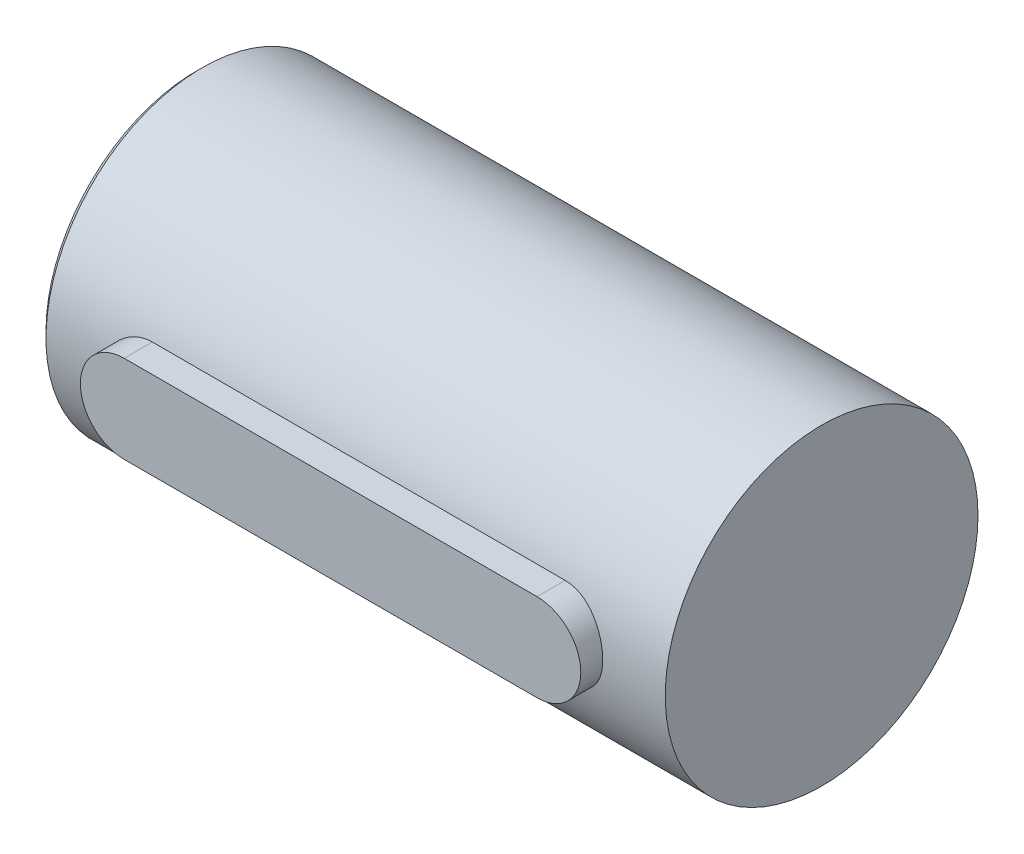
ISO-10303-21;
HEADER;
FILE_DESCRIPTION(('STEP AP214'),'2;1');
FILE_NAME('part.step','',(''),(''),'','','');
FILE_SCHEMA(('AUTOMOTIVE_DESIGN { 1 0 10303 214 1 1 1 1 }'));
ENDSEC;
DATA;
#1=APPLICATION_CONTEXT('core data for automotive mechanical design processes');
#2=APPLICATION_PROTOCOL_DEFINITION('international standard','automotive_design',2000,#1);
#3=PRODUCT_CONTEXT('',#1,'mechanical');
#4=PRODUCT('Part','Part','',(#3));
#5=PRODUCT_RELATED_PRODUCT_CATEGORY('part','',(#4));
#6=PRODUCT_DEFINITION_FORMATION('','',#4);
#7=PRODUCT_DEFINITION_CONTEXT('part definition',#1,'design');
#8=PRODUCT_DEFINITION('design','',#6,#7);
#9=PRODUCT_DEFINITION_SHAPE('','',#8);
#10=(LENGTH_UNIT() NAMED_UNIT(*) SI_UNIT(.MILLI.,.METRE.));
#11=(NAMED_UNIT(*) PLANE_ANGLE_UNIT() SI_UNIT($,.RADIAN.));
#12=(NAMED_UNIT(*) SI_UNIT($,.STERADIAN.) SOLID_ANGLE_UNIT());
#13=UNCERTAINTY_MEASURE_WITH_UNIT(LENGTH_MEASURE(1.E-05),#10,'distance_accuracy_value','');
#14=(GEOMETRIC_REPRESENTATION_CONTEXT(3) GLOBAL_UNCERTAINTY_ASSIGNED_CONTEXT((#13)) GLOBAL_UNIT_ASSIGNED_CONTEXT((#10,
#11,#12)) REPRESENTATION_CONTEXT('',''));
#15=CARTESIAN_POINT('',(0.,0.,0.));
#16=DIRECTION('',(0.,0.,1.));
#17=DIRECTION('',(1.,0.,0.));
#18=AXIS2_PLACEMENT_3D('',#15,#16,#17);
#19=CARTESIAN_POINT('',(-83.,0.,28.5));
#20=DIRECTION('',(0.,0.,1.));
#21=DIRECTION('',(0.,-1.,0.));
#22=AXIS2_PLACEMENT_3D('',#19,#20,#21);
#23=PLANE('',#22);
#24=CARTESIAN_POINT('',(-17.,0.,28.5));
#25=DIRECTION('',(0.,0.,1.));
#26=DIRECTION('',(0.,-1.,0.));
#27=AXIS2_PLACEMENT_3D('',#24,#25,#26);
#28=CIRCLE('',#27,7.);
#29=CARTESIAN_POINT('',(-17.,7.,28.5));
#30=VERTEX_POINT('',#29);
#31=CARTESIAN_POINT('',(-17.,-7.,28.5));
#32=VERTEX_POINT('',#31);
#33=EDGE_CURVE('E21',#30,#32,#28,.F.);
#34=ORIENTED_EDGE('',*,*,#33,.F.);
#35=DIRECTION('',(1.,0.,0.));
#36=VECTOR('',#35,1.);
#37=CARTESIAN_POINT('',(-50.,7.,28.5));
#38=LINE('',#37,#36);
#39=CARTESIAN_POINT('',(-83.,7.,28.5));
#40=VERTEX_POINT('',#39);
#41=EDGE_CURVE('E56',#30,#40,#38,.F.);
#42=ORIENTED_EDGE('',*,*,#41,.T.);
#43=CARTESIAN_POINT('',(-83.,0.,28.5));
#44=DIRECTION('',(0.,0.,1.));
#45=DIRECTION('',(0.,-1.,0.));
#46=AXIS2_PLACEMENT_3D('',#43,#44,#45);
#47=CIRCLE('',#46,7.);
#48=CARTESIAN_POINT('',(-83.,-7.,28.5));
#49=VERTEX_POINT('',#48);
#50=EDGE_CURVE('E65',#49,#40,#47,.F.);
#51=ORIENTED_EDGE('',*,*,#50,.F.);
#52=DIRECTION('',(1.,0.,0.));
#53=VECTOR('',#52,1.);
#54=CARTESIAN_POINT('',(-50.,-7.,28.5));
#55=LINE('',#54,#53);
#56=EDGE_CURVE('E61',#49,#32,#55,.T.);
#57=ORIENTED_EDGE('',*,*,#56,.T.);
#58=EDGE_LOOP('',(#34,#42,#51,#57));
#59=FACE_BOUND('',#58,.T.);
#60=ADVANCED_FACE('F16',(#59),#23,.T.);
#61=CARTESIAN_POINT('',(-50.,7.,14.25));
#62=DIRECTION('',(0.,-1.,0.));
#63=DIRECTION('',(0.,0.,-1.));
#64=AXIS2_PLACEMENT_3D('',#61,#62,#63);
#65=PLANE('',#64);
#66=DIRECTION('',(0.,0.,1.));
#67=VECTOR('',#66,1.);
#68=CARTESIAN_POINT('',(-83.,7.,14.25));
#69=LINE('',#68,#67);
#70=CARTESIAN_POINT('',(-83.,7.,24.));
#71=VERTEX_POINT('',#70);
#72=EDGE_CURVE('E118',#40,#71,#69,.F.);
#73=ORIENTED_EDGE('',*,*,#72,.F.);
#74=ORIENTED_EDGE('',*,*,#41,.F.);
#75=DIRECTION('',(0.,0.,1.));
#76=VECTOR('',#75,1.);
#77=CARTESIAN_POINT('',(-17.,7.,14.25));
#78=LINE('',#77,#76);
#79=CARTESIAN_POINT('',(-17.,7.,24.));
#80=VERTEX_POINT('',#79);
#81=EDGE_CURVE('E71',#80,#30,#78,.T.);
#82=ORIENTED_EDGE('',*,*,#81,.F.);
#83=DIRECTION('',(1.,0.,0.));
#84=VECTOR('',#83,1.);
#85=CARTESIAN_POINT('',(-49.5,7.,24.));
#86=LINE('',#85,#84);
#87=EDGE_CURVE('E114',#71,#80,#86,.T.);
#88=ORIENTED_EDGE('',*,*,#87,.F.);
#89=EDGE_LOOP('',(#73,#74,#82,#88));
#90=FACE_BOUND('',#89,.T.);
#91=ADVANCED_FACE('F125',(#90),#65,.F.);
#92=CARTESIAN_POINT('',(-100.,0.,-12.));
#93=DIRECTION('',(-1.,0.,0.));
#94=DIRECTION('',(0.,0.,1.));
#95=AXIS2_PLACEMENT_3D('',#92,#93,#94);
#96=PLANE('',#95);
#97=CARTESIAN_POINT('',(-100.,0.,0.));
#98=DIRECTION('',(1.,0.,0.));
#99=DIRECTION('',(0.,0.,-1.));
#100=AXIS2_PLACEMENT_3D('',#97,#98,#99);
#101=CIRCLE('',#100,24.);
#102=CARTESIAN_POINT('',(-100.,0.,-24.));
#103=VERTEX_POINT('',#102);
#104=EDGE_CURVE('E109',#103,#103,#101,.T.);
#105=ORIENTED_EDGE('',*,*,#104,.F.);
#106=EDGE_LOOP('',(#105));
#107=FACE_BOUND('',#106,.T.);
#108=ADVANCED_FACE('F127',(#107),#96,.T.);
#109=CARTESIAN_POINT('',(0.,0.,-12.5));
#110=DIRECTION('',(1.,0.,0.));
#111=DIRECTION('',(0.,0.,-1.));
#112=AXIS2_PLACEMENT_3D('',#109,#110,#111);
#113=PLANE('',#112);
#114=CARTESIAN_POINT('',(0.,0.,0.));
#115=DIRECTION('',(1.,0.,0.));
#116=DIRECTION('',(0.,0.,-1.));
#117=AXIS2_PLACEMENT_3D('',#114,#115,#116);
#118=CIRCLE('',#117,25.);
#119=CARTESIAN_POINT('',(0.,0.,-25.));
#120=VERTEX_POINT('',#119);
#121=EDGE_CURVE('E113',#120,#120,#118,.F.);
#122=ORIENTED_EDGE('',*,*,#121,.F.);
#123=EDGE_LOOP('',(#122));
#124=FACE_BOUND('',#123,.T.);
#125=ADVANCED_FACE('F133',(#124),#113,.T.);
#126=CARTESIAN_POINT('',(-17.,0.,14.25));
#127=DIRECTION('',(0.,0.,1.));
#128=DIRECTION('',(0.,-1.,0.));
#129=AXIS2_PLACEMENT_3D('',#126,#127,#128);
#130=CYLINDRICAL_SURFACE('',#129,7.);
#131=ORIENTED_EDGE('',*,*,#33,.T.);
#132=DIRECTION('',(0.,0.,1.));
#133=VECTOR('',#132,1.);
#134=CARTESIAN_POINT('',(-17.,-7.,14.25));
#135=LINE('',#134,#133);
#136=CARTESIAN_POINT('',(-17.,-7.,24.));
#137=VERTEX_POINT('',#136);
#138=EDGE_CURVE('E67',#32,#137,#135,.F.);
#139=ORIENTED_EDGE('',*,*,#138,.T.);
#140=CARTESIAN_POINT('',(-17.,7.,24.));
#141=CARTESIAN_POINT('',(-16.8072660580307,7.00002540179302,23.9999745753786));
#142=CARTESIAN_POINT('',(-16.6145411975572,6.99204120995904,24.0023207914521));
#143=CARTESIAN_POINT('',(-16.2305496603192,6.96024121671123,24.0115711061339));
#144=CARTESIAN_POINT('',(-16.0392826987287,6.93642859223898,24.0184742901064));
#145=CARTESIAN_POINT('',(-15.6600043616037,6.87323179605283,24.0366324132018));
#146=CARTESIAN_POINT('',(-15.4719865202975,6.83388349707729,24.0478773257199));
#147=CARTESIAN_POINT('',(-15.1000809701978,6.73996189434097,24.0743703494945));
#148=CARTESIAN_POINT('',(-14.9161933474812,6.68538827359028,24.0896185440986));
#149=CARTESIAN_POINT('',(-14.5538919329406,6.56149334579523,24.1236589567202));
#150=CARTESIAN_POINT('',(-14.3754756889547,6.49217875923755,24.1424495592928));
#151=CARTESIAN_POINT('',(-14.025136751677,6.33930046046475,24.183042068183));
#152=CARTESIAN_POINT('',(-13.8532164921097,6.25573147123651,24.204845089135));
#153=CARTESIAN_POINT('',(-13.5170362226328,6.07498022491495,24.2508413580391));
#154=CARTESIAN_POINT('',(-13.3527758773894,5.977798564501,24.2750345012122));
#155=CARTESIAN_POINT('',(-13.0328616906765,5.77045597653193,24.3251559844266));
#156=CARTESIAN_POINT('',(-12.8772109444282,5.660290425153,24.3510849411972));
#157=CARTESIAN_POINT('',(-12.5718170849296,5.42487534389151,24.404623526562));
#158=CARTESIAN_POINT('',(-12.4223124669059,5.29932214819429,24.4322587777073));
#159=CARTESIAN_POINT('',(-12.1343372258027,5.03620565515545,24.4878481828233));
#160=CARTESIAN_POINT('',(-11.9958667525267,4.89864219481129,24.5158023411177));
#161=CARTESIAN_POINT('',(-11.7307807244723,4.61231085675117,24.5712812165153));
#162=CARTESIAN_POINT('',(-11.6041714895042,4.46353708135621,24.5988056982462));
#163=CARTESIAN_POINT('',(-11.3637752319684,4.15584807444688,24.6526531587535));
#164=CARTESIAN_POINT('',(-11.2499837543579,3.99693639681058,24.6789765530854));
#165=CARTESIAN_POINT('',(-11.0339668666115,3.66688771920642,24.7301907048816));
#166=CARTESIAN_POINT('',(-10.9319964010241,3.49557812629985,24.7550456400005));
#167=CARTESIAN_POINT('',(-10.742940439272,3.14466419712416,24.8020646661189));
#168=CARTESIAN_POINT('',(-10.6558492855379,2.96506304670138,24.8242297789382));
#169=CARTESIAN_POINT('',(-10.4972741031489,2.59890688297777,24.8652282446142));
#170=CARTESIAN_POINT('',(-10.4257766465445,2.41235801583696,24.8840644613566));
#171=CARTESIAN_POINT('',(-10.2989219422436,2.03358085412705,24.9178795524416));
#172=CARTESIAN_POINT('',(-10.2435606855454,1.84135398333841,24.9328593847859));
#173=CARTESIAN_POINT('',(-10.1314115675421,1.37803390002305,24.9634434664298));
#174=CARTESIAN_POINT('',(-10.0822011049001,1.10493728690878,24.9770887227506));
#175=CARTESIAN_POINT('',(-10.0164981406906,0.55453170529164,24.9953653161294));
#176=CARTESIAN_POINT('',(-10.0000047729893,0.27722284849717,24.9999968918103));
#177=CARTESIAN_POINT('',(-9.99999668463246,-0.192561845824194,25.0000021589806));
#178=CARTESIAN_POINT('',(-10.0079488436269,-0.385082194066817,24.9977711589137));
#179=CARTESIAN_POINT('',(-10.0396813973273,-0.768771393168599,24.9889132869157));
#180=CARTESIAN_POINT('',(-10.0634649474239,-0.959939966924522,24.9822855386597));
#181=CARTESIAN_POINT('',(-10.1266776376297,-1.33959002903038,24.9648080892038));
#182=CARTESIAN_POINT('',(-10.1661163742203,-1.52806979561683,24.9539557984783));
#183=CARTESIAN_POINT('',(-10.2603150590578,-1.9009586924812,24.9283232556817));
#184=CARTESIAN_POINT('',(-10.3150807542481,-2.08536626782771,24.9135415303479));
#185=CARTESIAN_POINT('',(-10.4393607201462,-2.44841576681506,24.8804824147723));
#186=CARTESIAN_POINT('',(-10.5088455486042,-2.62706839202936,24.8622120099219));
#187=CARTESIAN_POINT('',(-10.6620807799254,-2.97782846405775,24.8226461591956));
#188=CARTESIAN_POINT('',(-10.7458365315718,-3.14993342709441,24.8013495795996));
#189=CARTESIAN_POINT('',(-11.0175373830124,-3.65456444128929,24.733760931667));
#190=CARTESIAN_POINT('',(-11.2260472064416,-3.97578751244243,24.683733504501));
#191=CARTESIAN_POINT('',(-11.6974519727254,-4.5864088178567,24.5777002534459));
#192=CARTESIAN_POINT('',(-11.9614793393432,-4.87491359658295,24.5215840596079));
#193=CARTESIAN_POINT('',(-12.3905321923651,-5.27170887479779,24.4382374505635));
#194=CARTESIAN_POINT('',(-12.5391539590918,-5.39804732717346,24.4105763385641));
#195=CARTESIAN_POINT('',(-12.8465158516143,-5.63795355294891,24.3562841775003));
#196=CARTESIAN_POINT('',(-13.0052521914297,-5.75152606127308,24.3296527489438));
#197=CARTESIAN_POINT('',(-13.3351082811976,-5.967259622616,24.2776519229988));
#198=CARTESIAN_POINT('',(-13.5064117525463,-6.06914821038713,24.2523182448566));
#199=CARTESIAN_POINT('',(-13.8573044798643,-6.25804683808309,24.2042629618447));
#200=CARTESIAN_POINT('',(-14.0368905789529,-6.34506248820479,24.1815403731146));
#201=CARTESIAN_POINT('',(-14.4030910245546,-6.50352480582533,24.1394054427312));
#202=CARTESIAN_POINT('',(-14.5897019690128,-6.57497889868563,24.1199915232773));
#203=CARTESIAN_POINT('',(-14.9686001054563,-6.70174206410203,24.0850775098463));
#204=CARTESIAN_POINT('',(-15.160885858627,-6.75705519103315,24.0695764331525));
#205=CARTESIAN_POINT('',(-15.6239925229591,-6.86897623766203,24.0379248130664));
#206=CARTESIAN_POINT('',(-15.8968357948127,-6.91805589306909,24.0237748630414));
#207=CARTESIAN_POINT('',(-16.308988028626,-6.96718708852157,24.0095511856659));
#208=CARTESIAN_POINT('',(-16.4468443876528,-6.97948276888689,24.0059768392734));
#209=CARTESIAN_POINT('',(-16.7231194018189,-6.99588985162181,24.0011992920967));
#210=CARTESIAN_POINT('',(-16.8615381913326,-6.99999916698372,23.9999966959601));
#211=CARTESIAN_POINT('',(-17.,-7.,24.));
#212=B_SPLINE_CURVE_WITH_KNOTS('',3,(#140,#141,#142,#143,#144,#145,#146,#147,#148,#149,#150,
#151,#152,#153,#154,#155,#156,#157,#158,#159,#160,#161,#162,#163,#164,#165,#166,#167,#168,#169,
#170,#171,#172,#173,#174,#175,#176,#177,#178,#179,#180,#181,#182,#183,#184,#185,#186,#187,#188,
#189,#190,#191,#192,#193,#194,#195,#196,#197,#198,#199,#200,#201,#202,#203,#204,#205,#206,#207,
#208,#209,#210,#211),.UNSPECIFIED.,.F.,.F.,(4,2,2,2,2,2,2,2,2,2,2,2,2,2,2,2,2,2,2,2,2,2,2,2,2,2,
2,2,2,2,2,2,2,2,2,4),(0.,0.578008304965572,1.15590063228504,1.73246630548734,2.30904398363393,
2.88535935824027,3.46188855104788,4.03839248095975,4.61510233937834,5.20595559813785,
5.79681687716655,6.38799120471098,6.97895942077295,7.58093641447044,8.18268400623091,
8.78391136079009,9.38498921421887,10.2163224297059,11.0476336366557,11.6250709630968,
12.2026234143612,12.7805304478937,13.3586544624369,13.9356328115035,14.5128278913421,
15.666019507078,16.8455253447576,17.4360093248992,18.0262735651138,18.6282989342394,
19.2300967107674,19.8316067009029,20.4329654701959,21.263328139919,21.6784561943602,
22.0936900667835),.UNSPECIFIED.);
#213=EDGE_CURVE('E86',#80,#137,#212,.T.);
#214=ORIENTED_EDGE('',*,*,#213,.F.);
#215=ORIENTED_EDGE('',*,*,#81,.T.);
#216=EDGE_LOOP('',(#131,#139,#214,#215));
#217=FACE_BOUND('',#216,.T.);
#218=ADVANCED_FACE('F70',(#217),#130,.T.);
#219=CARTESIAN_POINT('',(-50.,-7.,14.25));
#220=DIRECTION('',(0.,1.,0.));
#221=DIRECTION('',(0.,0.,1.));
#222=AXIS2_PLACEMENT_3D('',#219,#220,#221);
#223=PLANE('',#222);
#224=ORIENTED_EDGE('',*,*,#138,.F.);
#225=ORIENTED_EDGE('',*,*,#56,.F.);
#226=DIRECTION('',(0.,0.,1.));
#227=VECTOR('',#226,1.);
#228=CARTESIAN_POINT('',(-83.,-7.,14.25));
#229=LINE('',#228,#227);
#230=CARTESIAN_POINT('',(-83.,-7.,24.));
#231=VERTEX_POINT('',#230);
#232=EDGE_CURVE('E36',#231,#49,#229,.T.);
#233=ORIENTED_EDGE('',*,*,#232,.F.);
#234=DIRECTION('',(1.,0.,0.));
#235=VECTOR('',#234,1.);
#236=CARTESIAN_POINT('',(-49.5,-7.,24.));
#237=LINE('',#236,#235);
#238=EDGE_CURVE('E74',#137,#231,#237,.F.);
#239=ORIENTED_EDGE('',*,*,#238,.F.);
#240=EDGE_LOOP('',(#224,#225,#233,#239));
#241=FACE_BOUND('',#240,.T.);
#242=ADVANCED_FACE('F72',(#241),#223,.F.);
#243=CARTESIAN_POINT('',(-83.,0.,14.25));
#244=DIRECTION('',(0.,0.,1.));
#245=DIRECTION('',(0.,-1.,0.));
#246=AXIS2_PLACEMENT_3D('',#243,#244,#245);
#247=CYLINDRICAL_SURFACE('',#246,7.);
#248=ORIENTED_EDGE('',*,*,#50,.T.);
#249=ORIENTED_EDGE('',*,*,#72,.T.);
#250=CARTESIAN_POINT('',(-83.,-7.,24.));
#251=CARTESIAN_POINT('',(-83.1927339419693,-7.00002540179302,23.9999745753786));
#252=CARTESIAN_POINT('',(-83.3854588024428,-6.99204120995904,24.0023207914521));
#253=CARTESIAN_POINT('',(-83.7694503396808,-6.96024121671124,24.0115711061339));
#254=CARTESIAN_POINT('',(-83.9607173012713,-6.93642859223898,24.0184742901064));
#255=CARTESIAN_POINT('',(-84.3399956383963,-6.87323179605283,24.0366324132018));
#256=CARTESIAN_POINT('',(-84.5280134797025,-6.8338834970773,24.0478773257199));
#257=CARTESIAN_POINT('',(-84.8999190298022,-6.73996189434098,24.0743703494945));
#258=CARTESIAN_POINT('',(-85.0838066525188,-6.68538827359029,24.0896185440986));
#259=CARTESIAN_POINT('',(-85.4461080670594,-6.56149334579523,24.1236589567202));
#260=CARTESIAN_POINT('',(-85.6245243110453,-6.49217875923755,24.1424495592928));
#261=CARTESIAN_POINT('',(-85.974863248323,-6.33930046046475,24.183042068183));
#262=CARTESIAN_POINT('',(-86.1467835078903,-6.25573147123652,24.204845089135));
#263=CARTESIAN_POINT('',(-86.4829637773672,-6.07498022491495,24.2508413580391));
#264=CARTESIAN_POINT('',(-86.6472241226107,-5.977798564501,24.2750345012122));
#265=CARTESIAN_POINT('',(-86.9671383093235,-5.77045597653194,24.3251559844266));
#266=CARTESIAN_POINT('',(-87.1227890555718,-5.660290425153,24.3510849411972));
#267=CARTESIAN_POINT('',(-87.4281829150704,-5.42487534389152,24.404623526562));
#268=CARTESIAN_POINT('',(-87.5776875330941,-5.2993221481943,24.4322587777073));
#269=CARTESIAN_POINT('',(-87.8656627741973,-5.03620565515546,24.4878481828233));
#270=CARTESIAN_POINT('',(-88.0041332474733,-4.89864219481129,24.5158023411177));
#271=CARTESIAN_POINT('',(-88.2692192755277,-4.61231085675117,24.5712812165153));
#272=CARTESIAN_POINT('',(-88.3958285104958,-4.46353708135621,24.5988056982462));
#273=CARTESIAN_POINT('',(-88.6362247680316,-4.15584807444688,24.6526531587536));
#274=CARTESIAN_POINT('',(-88.7500162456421,-3.99693639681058,24.6789765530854));
#275=CARTESIAN_POINT('',(-88.9660331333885,-3.66688771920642,24.7301907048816));
#276=CARTESIAN_POINT('',(-89.0680035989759,-3.49557812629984,24.7550456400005));
#277=CARTESIAN_POINT('',(-89.2570595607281,-3.14466419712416,24.8020646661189));
#278=CARTESIAN_POINT('',(-89.3441507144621,-2.96506304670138,24.8242297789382));
#279=CARTESIAN_POINT('',(-89.5027258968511,-2.59890688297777,24.8652282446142));
#280=CARTESIAN_POINT('',(-89.5742233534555,-2.41235801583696,24.8840644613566));
#281=CARTESIAN_POINT('',(-89.7010780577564,-2.03358085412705,24.9178795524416));
#282=CARTESIAN_POINT('',(-89.7564393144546,-1.84135398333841,24.9328593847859));
#283=CARTESIAN_POINT('',(-89.8685884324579,-1.37803390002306,24.9634434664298));
#284=CARTESIAN_POINT('',(-89.9177988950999,-1.10493728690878,24.9770887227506));
#285=CARTESIAN_POINT('',(-89.9835018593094,-0.554531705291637,24.9953653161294));
#286=CARTESIAN_POINT('',(-89.9999952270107,-0.277222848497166,24.9999968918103));
#287=CARTESIAN_POINT('',(-90.0000033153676,0.192561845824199,25.0000021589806));
#288=CARTESIAN_POINT('',(-89.9920511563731,0.385082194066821,24.9977711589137));
#289=CARTESIAN_POINT('',(-89.9603186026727,0.768771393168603,24.9889132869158));
#290=CARTESIAN_POINT('',(-89.9365350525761,0.959939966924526,24.9822855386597));
#291=CARTESIAN_POINT('',(-89.8733223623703,1.33959002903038,24.9648080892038));
#292=CARTESIAN_POINT('',(-89.8338836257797,1.52806979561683,24.9539557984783));
#293=CARTESIAN_POINT('',(-89.7396849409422,1.9009586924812,24.9283232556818));
#294=CARTESIAN_POINT('',(-89.6849192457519,2.08536626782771,24.9135415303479));
#295=CARTESIAN_POINT('',(-89.5606392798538,2.44841576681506,24.8804824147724));
#296=CARTESIAN_POINT('',(-89.4911544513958,2.62706839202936,24.8622120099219));
#297=CARTESIAN_POINT('',(-89.3379192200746,2.97782846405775,24.8226461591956));
#298=CARTESIAN_POINT('',(-89.2541634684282,3.1499334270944,24.8013495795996));
#299=CARTESIAN_POINT('',(-88.9824626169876,3.65456444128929,24.733760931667));
#300=CARTESIAN_POINT('',(-88.7739527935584,3.97578751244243,24.683733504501));
#301=CARTESIAN_POINT('',(-88.3025480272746,4.5864088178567,24.577700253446));
#302=CARTESIAN_POINT('',(-88.0385206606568,4.87491359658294,24.5215840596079));
#303=CARTESIAN_POINT('',(-87.6094678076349,5.27170887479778,24.4382374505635));
#304=CARTESIAN_POINT('',(-87.4608460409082,5.39804732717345,24.4105763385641));
#305=CARTESIAN_POINT('',(-87.1534841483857,5.63795355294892,24.3562841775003));
#306=CARTESIAN_POINT('',(-86.9947478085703,5.75152606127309,24.3296527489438));
#307=CARTESIAN_POINT('',(-86.6648917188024,5.967259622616,24.2776519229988));
#308=CARTESIAN_POINT('',(-86.4935882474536,6.06914821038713,24.2523182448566));
#309=CARTESIAN_POINT('',(-86.1426955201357,6.25804683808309,24.2042629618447));
#310=CARTESIAN_POINT('',(-85.9631094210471,6.34506248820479,24.1815403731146));
#311=CARTESIAN_POINT('',(-85.5969089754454,6.50352480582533,24.1394054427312));
#312=CARTESIAN_POINT('',(-85.4102980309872,6.57497889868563,24.1199915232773));
#313=CARTESIAN_POINT('',(-85.0313998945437,6.70174206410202,24.0850775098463));
#314=CARTESIAN_POINT('',(-84.839114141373,6.75705519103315,24.0695764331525));
#315=CARTESIAN_POINT('',(-84.3760074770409,6.86897623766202,24.0379248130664));
#316=CARTESIAN_POINT('',(-84.1031642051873,6.91805589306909,24.0237748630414));
#317=CARTESIAN_POINT('',(-83.691011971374,6.96718708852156,24.0095511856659));
#318=CARTESIAN_POINT('',(-83.5531556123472,6.97948276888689,24.0059768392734));
#319=CARTESIAN_POINT('',(-83.2768805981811,6.9958898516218,24.0011992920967));
#320=CARTESIAN_POINT('',(-83.1384618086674,6.99999916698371,23.9999966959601));
#321=CARTESIAN_POINT('',(-83.,7.,24.));
#322=B_SPLINE_CURVE_WITH_KNOTS('',3,(#250,#251,#252,#253,#254,#255,#256,#257,#258,#259,#260,
#261,#262,#263,#264,#265,#266,#267,#268,#269,#270,#271,#272,#273,#274,#275,#276,#277,#278,#279,
#280,#281,#282,#283,#284,#285,#286,#287,#288,#289,#290,#291,#292,#293,#294,#295,#296,#297,#298,
#299,#300,#301,#302,#303,#304,#305,#306,#307,#308,#309,#310,#311,#312,#313,#314,#315,#316,#317,
#318,#319,#320,#321),.UNSPECIFIED.,.F.,.F.,(4,2,2,2,2,2,2,2,2,2,2,2,2,2,2,2,2,2,2,2,2,2,2,2,2,2,
2,2,2,2,2,2,2,2,2,4),(0.,0.578008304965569,1.15590063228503,1.73246630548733,2.30904398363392,
2.88535935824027,3.46188855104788,4.03839248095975,4.61510233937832,5.20595559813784,
5.79681687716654,6.38799120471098,6.97895942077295,7.58093641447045,8.18268400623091,
8.78391136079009,9.38498921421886,10.2163224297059,11.0476336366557,11.6250709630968,
12.2026234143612,12.7805304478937,13.3586544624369,13.9356328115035,14.5128278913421,
15.666019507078,16.8455253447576,17.4360093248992,18.0262735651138,18.6282989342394,
19.2300967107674,19.8316067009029,20.4329654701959,21.263328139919,21.6784561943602,
22.0936900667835),.UNSPECIFIED.);
#323=EDGE_CURVE('E27',#231,#71,#322,.T.);
#324=ORIENTED_EDGE('',*,*,#323,.F.);
#325=ORIENTED_EDGE('',*,*,#232,.T.);
#326=EDGE_LOOP('',(#248,#249,#324,#325));
#327=FACE_BOUND('',#326,.T.);
#328=ADVANCED_FACE('F92',(#327),#247,.T.);
#329=CARTESIAN_POINT('',(-99.,0.,0.));
#330=DIRECTION('',(1.,0.,0.));
#331=DIRECTION('',(0.,0.,-1.));
#332=AXIS2_PLACEMENT_3D('',#329,#330,#331);
#333=CONICAL_SURFACE('',#332,25.,0.78539816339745);
#334=ORIENTED_EDGE('',*,*,#104,.T.);
#335=EDGE_LOOP('',(#334));
#336=FACE_BOUND('',#335,.T.);
#337=CARTESIAN_POINT('',(-99.,0.,0.));
#338=DIRECTION('',(1.,0.,0.));
#339=DIRECTION('',(0.,0.,-1.));
#340=AXIS2_PLACEMENT_3D('',#337,#338,#339);
#341=CIRCLE('',#340,25.);
#342=CARTESIAN_POINT('',(-99.,0.,-25.));
#343=VERTEX_POINT('',#342);
#344=EDGE_CURVE('E11',#343,#343,#341,.T.);
#345=ORIENTED_EDGE('',*,*,#344,.F.);
#346=EDGE_LOOP('',(#345));
#347=FACE_BOUND('',#346,.T.);
#348=ADVANCED_FACE('F96',(#336,#347),#333,.T.);
#349=CARTESIAN_POINT('',(-49.5,0.,0.));
#350=DIRECTION('',(1.,0.,0.));
#351=DIRECTION('',(0.,0.,-1.));
#352=AXIS2_PLACEMENT_3D('',#349,#350,#351);
#353=CYLINDRICAL_SURFACE('',#352,25.);
#354=ORIENTED_EDGE('',*,*,#121,.T.);
#355=EDGE_LOOP('',(#354));
#356=FACE_BOUND('',#355,.T.);
#357=ORIENTED_EDGE('',*,*,#87,.T.);
#358=ORIENTED_EDGE('',*,*,#213,.T.);
#359=ORIENTED_EDGE('',*,*,#238,.T.);
#360=ORIENTED_EDGE('',*,*,#323,.T.);
#361=EDGE_LOOP('',(#357,#358,#359,#360));
#362=FACE_BOUND('',#361,.T.);
#363=ORIENTED_EDGE('',*,*,#344,.T.);
#364=EDGE_LOOP('',(#363));
#365=FACE_BOUND('',#364,.T.);
#366=ADVANCED_FACE('F18',(#356,#362,#365),#353,.T.);
#367=CLOSED_SHELL('',(#60,#91,#108,#125,#218,#242,#328,#348,#366));
#368=MANIFOLD_SOLID_BREP('B1',#367);
#369=ADVANCED_BREP_SHAPE_REPRESENTATION('',(#18,#368),#14);
#370=SHAPE_DEFINITION_REPRESENTATION(#9,#369);
ENDSEC;
END-ISO-10303-21;
